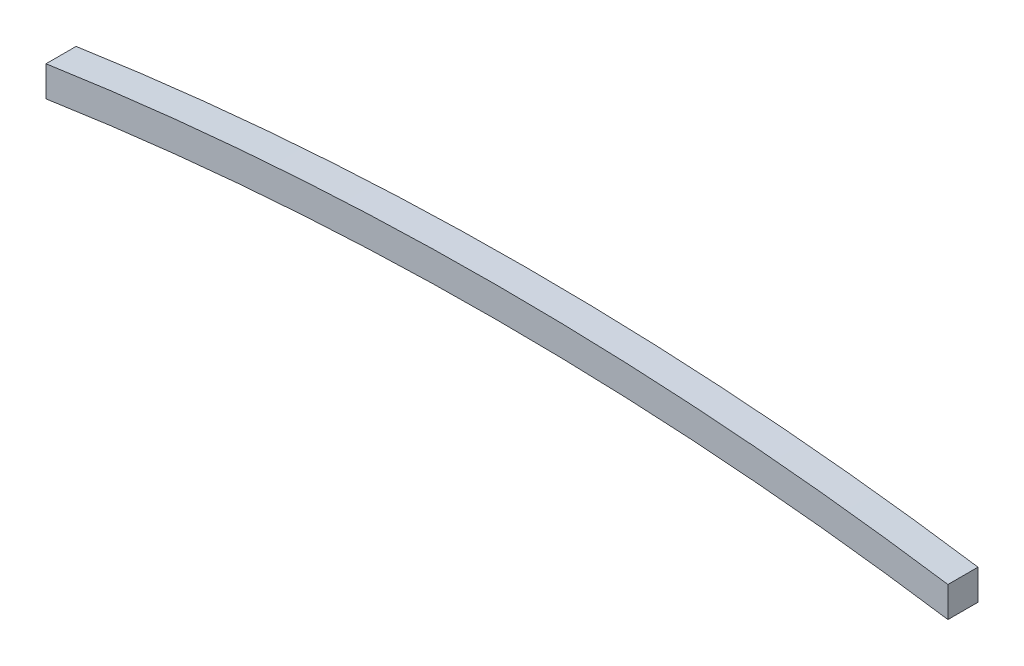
ISO-10303-21;
HEADER;
FILE_DESCRIPTION(('STEP AP214'),'2;1');
FILE_NAME('part.step','',(''),(''),'','','');
FILE_SCHEMA(('AUTOMOTIVE_DESIGN { 1 0 10303 214 1 1 1 1 }'));
ENDSEC;
DATA;
#1=APPLICATION_CONTEXT('core data for automotive mechanical design processes');
#2=APPLICATION_PROTOCOL_DEFINITION('international standard','automotive_design',2000,#1);
#3=PRODUCT_CONTEXT('',#1,'mechanical');
#4=PRODUCT('Part','Part','',(#3));
#5=PRODUCT_RELATED_PRODUCT_CATEGORY('part','',(#4));
#6=PRODUCT_DEFINITION_FORMATION('','',#4);
#7=PRODUCT_DEFINITION_CONTEXT('part definition',#1,'design');
#8=PRODUCT_DEFINITION('design','',#6,#7);
#9=PRODUCT_DEFINITION_SHAPE('','',#8);
#10=(LENGTH_UNIT() NAMED_UNIT(*) SI_UNIT(.MILLI.,.METRE.));
#11=(NAMED_UNIT(*) PLANE_ANGLE_UNIT() SI_UNIT($,.RADIAN.));
#12=(NAMED_UNIT(*) SI_UNIT($,.STERADIAN.) SOLID_ANGLE_UNIT());
#13=UNCERTAINTY_MEASURE_WITH_UNIT(LENGTH_MEASURE(1.E-05),#10,'distance_accuracy_value','');
#14=(GEOMETRIC_REPRESENTATION_CONTEXT(3) GLOBAL_UNCERTAINTY_ASSIGNED_CONTEXT((#13)) GLOBAL_UNIT_ASSIGNED_CONTEXT((#10,
#11,#12)) REPRESENTATION_CONTEXT('',''));
#15=CARTESIAN_POINT('',(0.,0.,0.));
#16=DIRECTION('',(0.,0.,1.));
#17=DIRECTION('',(1.,0.,0.));
#18=AXIS2_PLACEMENT_3D('',#15,#16,#17);
#19=CARTESIAN_POINT('',(1500.,-1116.52349681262,-50.));
#20=DIRECTION('',(1.,0.,0.));
#21=DIRECTION('',(0.,0.,-1.));
#22=AXIS2_PLACEMENT_3D('',#19,#20,#21);
#23=PLANE('',#22);
#24=DIRECTION('',(0.,1.,0.));
#25=VECTOR('',#24,1.);
#26=CARTESIAN_POINT('',(1500.,-1116.52349681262,0.));
#27=LINE('',#26,#25);
#28=CARTESIAN_POINT('',(1500.,0.,0.));
#29=VERTEX_POINT('',#28);
#30=CARTESIAN_POINT('',(1500.,50.5664123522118,0.));
#31=VERTEX_POINT('',#30);
#32=EDGE_CURVE('E97',#29,#31,#27,.T.);
#33=ORIENTED_EDGE('',*,*,#32,.F.);
#34=DIRECTION('',(0.,0.,1.));
#35=VECTOR('',#34,1.);
#36=CARTESIAN_POINT('',(1500.,0.,-50.));
#37=LINE('',#36,#35);
#38=CARTESIAN_POINT('',(1500.,0.,-50.));
#39=VERTEX_POINT('',#38);
#40=EDGE_CURVE('E11',#39,#29,#37,.T.);
#41=ORIENTED_EDGE('',*,*,#40,.F.);
#42=DIRECTION('',(0.,1.,0.));
#43=VECTOR('',#42,1.);
#44=CARTESIAN_POINT('',(1500.,-1116.52349681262,-50.));
#45=LINE('',#44,#43);
#46=CARTESIAN_POINT('',(1500.,50.5664123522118,-50.));
#47=VERTEX_POINT('',#46);
#48=EDGE_CURVE('E92',#39,#47,#45,.T.);
#49=ORIENTED_EDGE('',*,*,#48,.T.);
#50=DIRECTION('',(0.,0.,1.));
#51=VECTOR('',#50,1.);
#52=CARTESIAN_POINT('',(1500.,50.5664123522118,-50.));
#53=LINE('',#52,#51);
#54=EDGE_CURVE('E35',#47,#31,#53,.T.);
#55=ORIENTED_EDGE('',*,*,#54,.T.);
#56=EDGE_LOOP('',(#33,#41,#49,#55));
#57=FACE_BOUND('',#56,.T.);
#58=ADVANCED_FACE('F32',(#57),#23,.T.);
#59=CARTESIAN_POINT('',(750.000000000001,-4943.4299833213,-50.));
#60=DIRECTION('',(0.,0.,1.));
#61=DIRECTION('',(1.,0.,0.));
#62=AXIS2_PLACEMENT_3D('',#59,#60,#61);
#63=CYLINDRICAL_SURFACE('',#62,5000.);
#64=CARTESIAN_POINT('',(750.000000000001,-4943.4299833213,0.));
#65=DIRECTION('',(0.,0.,1.));
#66=DIRECTION('',(1.,0.,0.));
#67=AXIS2_PLACEMENT_3D('',#64,#65,#66);
#68=CIRCLE('',#67,5000.);
#69=CARTESIAN_POINT('',(0.,0.,0.));
#70=VERTEX_POINT('',#69);
#71=EDGE_CURVE('E65',#29,#70,#68,.T.);
#72=ORIENTED_EDGE('',*,*,#71,.T.);
#73=DIRECTION('',(0.,0.,1.));
#74=VECTOR('',#73,1.);
#75=CARTESIAN_POINT('',(0.,0.,-50.));
#76=LINE('',#75,#74);
#77=CARTESIAN_POINT('',(0.,0.,-50.));
#78=VERTEX_POINT('',#77);
#79=EDGE_CURVE('E41',#78,#70,#76,.T.);
#80=ORIENTED_EDGE('',*,*,#79,.F.);
#81=CARTESIAN_POINT('',(750.000000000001,-4943.4299833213,-50.));
#82=DIRECTION('',(0.,0.,1.));
#83=DIRECTION('',(1.,0.,0.));
#84=AXIS2_PLACEMENT_3D('',#81,#82,#83);
#85=CIRCLE('',#84,5000.);
#86=EDGE_CURVE('E82',#39,#78,#85,.T.);
#87=ORIENTED_EDGE('',*,*,#86,.F.);
#88=ORIENTED_EDGE('',*,*,#40,.T.);
#89=EDGE_LOOP('',(#72,#80,#87,#88));
#90=FACE_BOUND('',#89,.T.);
#91=ADVANCED_FACE('F107',(#90),#63,.F.);
#92=CARTESIAN_POINT('',(0.,-1116.52349681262,-50.));
#93=DIRECTION('',(1.,0.,0.));
#94=DIRECTION('',(0.,0.,-1.));
#95=AXIS2_PLACEMENT_3D('',#92,#93,#94);
#96=PLANE('',#95);
#97=DIRECTION('',(0.,1.,0.));
#98=VECTOR('',#97,1.);
#99=CARTESIAN_POINT('',(0.,-1116.52349681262,0.));
#100=LINE('',#99,#98);
#101=CARTESIAN_POINT('',(0.,50.5664123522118,0.));
#102=VERTEX_POINT('',#101);
#103=EDGE_CURVE('E89',#70,#102,#100,.T.);
#104=ORIENTED_EDGE('',*,*,#103,.T.);
#105=DIRECTION('',(0.,0.,1.));
#106=VECTOR('',#105,1.);
#107=CARTESIAN_POINT('',(0.,50.5664123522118,-50.));
#108=LINE('',#107,#106);
#109=CARTESIAN_POINT('',(0.,50.5664123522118,-50.));
#110=VERTEX_POINT('',#109);
#111=EDGE_CURVE('E86',#110,#102,#108,.T.);
#112=ORIENTED_EDGE('',*,*,#111,.F.);
#113=DIRECTION('',(0.,1.,0.));
#114=VECTOR('',#113,1.);
#115=CARTESIAN_POINT('',(0.,-1116.52349681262,-50.));
#116=LINE('',#115,#114);
#117=EDGE_CURVE('E77',#78,#110,#116,.T.);
#118=ORIENTED_EDGE('',*,*,#117,.F.);
#119=ORIENTED_EDGE('',*,*,#79,.T.);
#120=EDGE_LOOP('',(#104,#112,#118,#119));
#121=FACE_BOUND('',#120,.T.);
#122=ADVANCED_FACE('F87',(#121),#96,.F.);
#123=CARTESIAN_POINT('',(750.000000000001,-4943.4299833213,-50.));
#124=DIRECTION('',(0.,0.,1.));
#125=DIRECTION('',(1.,0.,0.));
#126=AXIS2_PLACEMENT_3D('',#123,#124,#125);
#127=CYLINDRICAL_SURFACE('',#126,5050.);
#128=CARTESIAN_POINT('',(750.000000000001,-4943.4299833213,0.));
#129=DIRECTION('',(0.,0.,1.));
#130=DIRECTION('',(1.,0.,0.));
#131=AXIS2_PLACEMENT_3D('',#128,#129,#130);
#132=CIRCLE('',#131,5050.);
#133=EDGE_CURVE('E100',#31,#102,#132,.T.);
#134=ORIENTED_EDGE('',*,*,#133,.F.);
#135=ORIENTED_EDGE('',*,*,#54,.F.);
#136=CARTESIAN_POINT('',(750.000000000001,-4943.4299833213,-50.));
#137=DIRECTION('',(0.,0.,1.));
#138=DIRECTION('',(1.,0.,0.));
#139=AXIS2_PLACEMENT_3D('',#136,#137,#138);
#140=CIRCLE('',#139,5050.);
#141=EDGE_CURVE('E81',#47,#110,#140,.T.);
#142=ORIENTED_EDGE('',*,*,#141,.T.);
#143=ORIENTED_EDGE('',*,*,#111,.T.);
#144=EDGE_LOOP('',(#134,#135,#142,#143));
#145=FACE_BOUND('',#144,.T.);
#146=ADVANCED_FACE('F91',(#145),#127,.T.);
#147=CARTESIAN_POINT('',(750.,-1116.52349681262,-50.));
#148=DIRECTION('',(0.,0.,1.));
#149=DIRECTION('',(1.,0.,0.));
#150=AXIS2_PLACEMENT_3D('',#147,#148,#149);
#151=PLANE('',#150);
#152=ORIENTED_EDGE('',*,*,#48,.F.);
#153=ORIENTED_EDGE('',*,*,#86,.T.);
#154=ORIENTED_EDGE('',*,*,#117,.T.);
#155=ORIENTED_EDGE('',*,*,#141,.F.);
#156=EDGE_LOOP('',(#152,#153,#154,#155));
#157=FACE_BOUND('',#156,.T.);
#158=ADVANCED_FACE('F80',(#157),#151,.F.);
#159=CARTESIAN_POINT('',(750.,-1116.52349681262,0.));
#160=DIRECTION('',(0.,0.,1.));
#161=DIRECTION('',(1.,0.,0.));
#162=AXIS2_PLACEMENT_3D('',#159,#160,#161);
#163=PLANE('',#162);
#164=ORIENTED_EDGE('',*,*,#32,.T.);
#165=ORIENTED_EDGE('',*,*,#133,.T.);
#166=ORIENTED_EDGE('',*,*,#103,.F.);
#167=ORIENTED_EDGE('',*,*,#71,.F.);
#168=EDGE_LOOP('',(#164,#165,#166,#167));
#169=FACE_BOUND('',#168,.T.);
#170=ADVANCED_FACE('F105',(#169),#163,.T.);
#171=CLOSED_SHELL('',(#58,#91,#122,#146,#158,#170));
#172=MANIFOLD_SOLID_BREP('B2',#171);
#173=ADVANCED_BREP_SHAPE_REPRESENTATION('',(#18,#172),#14);
#174=SHAPE_DEFINITION_REPRESENTATION(#9,#173);
ENDSEC;
END-ISO-10303-21;
